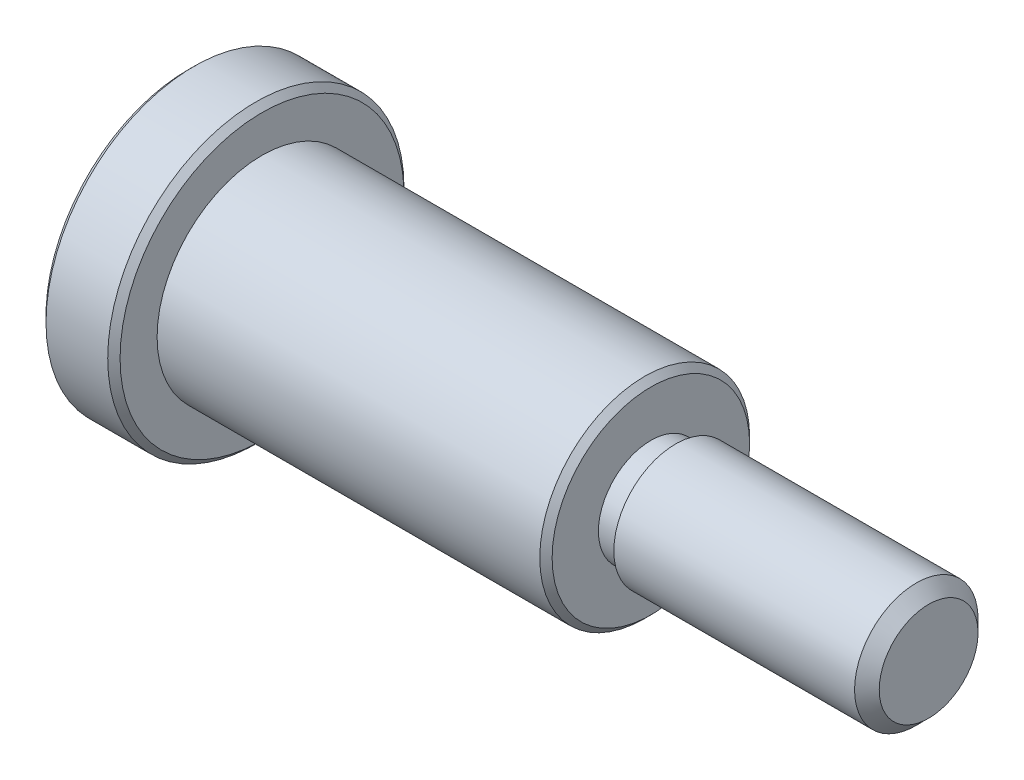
ISO-10303-21;
HEADER;
FILE_DESCRIPTION(('STEP AP214'),'2;1');
FILE_NAME('part.step','',(''),(''),'','','');
FILE_SCHEMA(('AUTOMOTIVE_DESIGN { 1 0 10303 214 1 1 1 1 }'));
ENDSEC;
DATA;
#1=APPLICATION_CONTEXT('core data for automotive mechanical design processes');
#2=APPLICATION_PROTOCOL_DEFINITION('international standard','automotive_design',2000,#1);
#3=PRODUCT_CONTEXT('',#1,'mechanical');
#4=PRODUCT('Part','Part','',(#3));
#5=PRODUCT_RELATED_PRODUCT_CATEGORY('part','',(#4));
#6=PRODUCT_DEFINITION_FORMATION('','',#4);
#7=PRODUCT_DEFINITION_CONTEXT('part definition',#1,'design');
#8=PRODUCT_DEFINITION('design','',#6,#7);
#9=PRODUCT_DEFINITION_SHAPE('','',#8);
#10=(LENGTH_UNIT() NAMED_UNIT(*) SI_UNIT(.MILLI.,.METRE.));
#11=(NAMED_UNIT(*) PLANE_ANGLE_UNIT() SI_UNIT($,.RADIAN.));
#12=(NAMED_UNIT(*) SI_UNIT($,.STERADIAN.) SOLID_ANGLE_UNIT());
#13=UNCERTAINTY_MEASURE_WITH_UNIT(LENGTH_MEASURE(1.E-05),#10,'distance_accuracy_value','');
#14=(GEOMETRIC_REPRESENTATION_CONTEXT(3) GLOBAL_UNCERTAINTY_ASSIGNED_CONTEXT((#13)) GLOBAL_UNIT_ASSIGNED_CONTEXT((#10,
#11,#12)) REPRESENTATION_CONTEXT('',''));
#15=CARTESIAN_POINT('',(0.,0.,0.));
#16=DIRECTION('',(0.,0.,1.));
#17=DIRECTION('',(1.,0.,0.));
#18=AXIS2_PLACEMENT_3D('',#15,#16,#17);
#19=CARTESIAN_POINT('',(0.999999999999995,0.,0.));
#20=DIRECTION('',(-1.,0.,0.));
#21=DIRECTION('',(0.,0.,1.));
#22=AXIS2_PLACEMENT_3D('',#19,#20,#21);
#23=CONICAL_SURFACE('',#22,5.,0.78539816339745);
#24=CARTESIAN_POINT('',(-2.07559788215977,-6.18185094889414,5.19615242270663));
#25=CARTESIAN_POINT('',(-1.96105952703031,-6.03219120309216,5.19615242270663));
#26=CARTESIAN_POINT('',(-1.84756955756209,-5.88171616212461,5.19615242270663));
#27=CARTESIAN_POINT('',(-1.62316269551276,-5.57880548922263,5.19615242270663));
#28=CARTESIAN_POINT('',(-1.51224642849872,-5.42636939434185,5.19615242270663));
#29=CARTESIAN_POINT('',(-1.29267383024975,-5.11809191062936,5.19615242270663));
#30=CARTESIAN_POINT('',(-1.18404158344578,-4.96223331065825,5.19615242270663));
#31=CARTESIAN_POINT('',(-0.970632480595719,-4.64790705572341,5.19615242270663));
#32=CARTESIAN_POINT('',(-0.865855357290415,-4.48943958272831,5.19615242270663));
#33=CARTESIAN_POINT('',(-0.654718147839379,-4.15960466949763,5.19615242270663));
#34=CARTESIAN_POINT('',(-0.548658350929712,-3.98804403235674,5.19615242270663));
#35=CARTESIAN_POINT('',(-0.343229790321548,-3.64089952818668,5.19615242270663));
#36=CARTESIAN_POINT('',(-0.243862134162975,-3.46531500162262,5.19615242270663));
#37=CARTESIAN_POINT('',(-0.0539420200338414,-3.11009275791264,5.19615242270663));
#38=CARTESIAN_POINT('',(0.0366363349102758,-2.93046899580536,5.19615242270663));
#39=CARTESIAN_POINT('',(0.206948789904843,-2.56619278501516,5.19615242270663));
#40=CARTESIAN_POINT('',(0.286687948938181,-2.38154273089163,5.19615242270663));
#41=CARTESIAN_POINT('',(0.425614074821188,-2.0244068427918,5.19615242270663));
#42=CARTESIAN_POINT('',(0.486026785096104,-1.85240274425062,5.19615242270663));
#43=CARTESIAN_POINT('',(0.593076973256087,-1.50407975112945,5.19615242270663));
#44=CARTESIAN_POINT('',(0.639713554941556,-1.32776057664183,5.19615242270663));
#45=CARTESIAN_POINT('',(0.715936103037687,-0.974891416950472,5.19615242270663));
#46=CARTESIAN_POINT('',(0.745826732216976,-0.798408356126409,5.19615242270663));
#47=CARTESIAN_POINT('',(0.787945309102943,-0.443335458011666,5.19615242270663));
#48=CARTESIAN_POINT('',(0.800176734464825,-0.264746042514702,5.19615242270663));
#49=CARTESIAN_POINT('',(0.805972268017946,0.0853231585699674,5.19615242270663));
#50=CARTESIAN_POINT('',(0.80028947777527,0.256790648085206,5.19615242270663));
#51=CARTESIAN_POINT('',(0.772281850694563,0.598351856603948,5.19615242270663));
#52=CARTESIAN_POINT('',(0.749955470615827,0.768445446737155,5.19615242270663));
#53=CARTESIAN_POINT('',(0.68953098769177,1.1089080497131,5.19615242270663));
#54=CARTESIAN_POINT('',(0.651157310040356,1.27922733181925,5.19615242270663));
#55=CARTESIAN_POINT('',(0.560743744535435,1.61612737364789,5.19615242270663));
#56=CARTESIAN_POINT('',(0.508704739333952,1.78270837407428,5.19615242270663));
#57=CARTESIAN_POINT('',(0.389334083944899,2.12288400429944,5.19615242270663));
#58=CARTESIAN_POINT('',(0.321209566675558,2.29619732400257,5.19615242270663));
#59=CARTESIAN_POINT('',(0.174451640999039,2.63835544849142,5.19615242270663));
#60=CARTESIAN_POINT('',(0.0958134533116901,2.80719817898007,5.19615242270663));
#61=CARTESIAN_POINT('',(-0.0701055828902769,3.14121944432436,5.19615242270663));
#62=CARTESIAN_POINT('',(-0.157413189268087,3.30638457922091,5.19615242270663));
#63=CARTESIAN_POINT('',(-0.338747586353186,3.63292620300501,5.19615242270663));
#64=CARTESIAN_POINT('',(-0.432773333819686,3.79430327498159,5.19615242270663));
#65=CARTESIAN_POINT('',(-0.62144544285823,4.1058655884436,5.19615242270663));
#66=CARTESIAN_POINT('',(-0.715831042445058,4.25620957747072,5.19615242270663));
#67=CARTESIAN_POINT('',(-0.908608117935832,4.55431494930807,5.19615242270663));
#68=CARTESIAN_POINT('',(-1.00699989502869,4.70207613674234,5.19615242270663));
#69=CARTESIAN_POINT('',(-1.20627052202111,4.99416315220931,5.19615242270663));
#70=CARTESIAN_POINT('',(-1.30712296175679,5.13850706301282,5.19615242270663));
#71=CARTESIAN_POINT('',(-1.51152254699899,5.42521646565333,5.19615242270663));
#72=CARTESIAN_POINT('',(-1.61506894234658,5.56758249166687,5.19615242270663));
#73=CARTESIAN_POINT('',(-1.71971772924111,5.70911918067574,5.19615242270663));
#74=B_SPLINE_CURVE_WITH_KNOTS('',3,(#24,#25,#26,#27,#28,#29,#30,#31,#32,#33,#34,#35,#36,#37,#38,
#39,#40,#41,#42,#43,#44,#45,#46,#47,#48,#49,#50,#51,#52,#53,#54,#55,#56,#57,#58,#59,#60,#61,#62,
#63,#64,#65,#66,#67,#68,#69,#70,#71,#72,#73),.UNSPECIFIED.,.F.,.F.,(4,2,2,2,2,2,2,2,2,2,2,2,2,2,
2,2,2,2,2,2,2,2,2,2,4),(0.,0.565389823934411,1.13091566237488,1.70081124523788,2.27066724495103,
2.87563727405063,3.48070718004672,4.08393641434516,4.68688312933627,5.23332426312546,
5.77980093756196,6.31598261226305,6.85205868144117,7.36590358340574,7.87979613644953,
8.40290159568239,8.92597327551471,9.48420805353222,10.0426974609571,10.6029676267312,
11.1631509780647,11.6956247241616,12.2281385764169,12.7563639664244,13.2844438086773),.UNSPECIFIED.);
#75=CARTESIAN_POINT('',(0.,-3.,5.19615242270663));
#76=VERTEX_POINT('',#75);
#77=CARTESIAN_POINT('',(0.,3.,5.19615242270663));
#78=VERTEX_POINT('',#77);
#79=EDGE_CURVE('E11',#76,#78,#74,.T.);
#80=ORIENTED_EDGE('',*,*,#79,.F.);
#81=CARTESIAN_POINT('',(0.,0.,0.));
#82=DIRECTION('',(1.,0.,0.));
#83=DIRECTION('',(0.,0.,-1.));
#84=AXIS2_PLACEMENT_3D('',#81,#82,#83);
#85=CIRCLE('',#84,6.);
#86=EDGE_CURVE('E269',#78,#76,#85,.T.);
#87=ORIENTED_EDGE('',*,*,#86,.F.);
#88=EDGE_LOOP('',(#80,#87));
#89=FACE_BOUND('',#88,.T.);
#90=ADVANCED_FACE('F36',(#89),#23,.F.);
#91=CARTESIAN_POINT('',(-0.000115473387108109,-6.00011547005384,-0.0001999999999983));
#92=CARTESIAN_POINT('',(0.0514632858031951,-5.94853194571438,0.0891452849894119));
#93=CARTESIAN_POINT('',(0.101459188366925,-5.89655192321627,0.179177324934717));
#94=CARTESIAN_POINT('',(0.197803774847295,-5.79172109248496,0.360749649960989));
#95=CARTESIAN_POINT('',(0.244150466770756,-5.73886982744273,0.452290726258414));
#96=CARTESIAN_POINT('',(0.377389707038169,-5.57840146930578,0.730230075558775));
#97=CARTESIAN_POINT('',(0.457912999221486,-5.46942591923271,0.9189812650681));
#98=CARTESIAN_POINT('',(0.59580367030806,-5.2496679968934,1.29961315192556));
#99=CARTESIAN_POINT('',(0.653518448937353,-5.13894179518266,1.49139655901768));
#100=CARTESIAN_POINT('',(0.720280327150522,-4.97103208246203,1.7822247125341));
#101=CARTESIAN_POINT('',(0.739223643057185,-4.91481496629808,1.87959561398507));
#102=CARTESIAN_POINT('',(0.77007816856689,-4.80190472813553,2.0751618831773));
#103=CARTESIAN_POINT('',(0.781990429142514,-4.74521167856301,2.17335712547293));
#104=CARTESIAN_POINT('',(0.801962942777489,-4.60705943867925,2.41264382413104));
#105=CARTESIAN_POINT('',(0.806153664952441,-4.5254513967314,2.55399309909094));
#106=CARTESIAN_POINT('',(0.799120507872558,-4.36238238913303,2.83643690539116));
#107=CARTESIAN_POINT('',(0.787891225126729,-4.28092148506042,2.97753133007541));
#108=CARTESIAN_POINT('',(0.750679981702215,-4.11876766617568,3.25838998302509));
#109=CARTESIAN_POINT('',(0.724681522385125,-4.03807571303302,3.39815254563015));
#110=CARTESIAN_POINT('',(0.659345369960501,-3.87807870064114,3.67527550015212));
#111=CARTESIAN_POINT('',(0.620008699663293,-3.79877353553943,3.81263607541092));
#112=CARTESIAN_POINT('',(0.539080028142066,-3.65799091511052,4.05647872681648));
#113=CARTESIAN_POINT('',(0.499616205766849,-3.5962017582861,4.16350068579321));
#114=CARTESIAN_POINT('',(0.41432892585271,-3.47373266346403,4.37562338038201));
#115=CARTESIAN_POINT('',(0.368505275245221,-3.41305275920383,4.48072405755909));
#116=CARTESIAN_POINT('',(0.271525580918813,-3.29299328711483,4.68867316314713));
#117=CARTESIAN_POINT('',(0.220386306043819,-3.23361030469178,4.79152750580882));
#118=CARTESIAN_POINT('',(0.113446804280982,-3.11594398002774,4.99533155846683));
#119=CARTESIAN_POINT('',(0.0576494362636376,-3.05765998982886,5.09628239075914));
#120=CARTESIAN_POINT('',(-0.00011547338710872,-2.99988452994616,5.19635242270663));
#121=B_SPLINE_CURVE_WITH_KNOTS('',3,(#91,#92,#93,#94,#95,#96,#97,#98,#99,#100,#101,#102,#103,
#104,#105,#106,#107,#108,#109,#110,#111,#112,#113,#114,#115,#116,#117,#118,#119,#120),
.UNSPECIFIED.,.F.,.F.,(4,2,2,2,2,2,2,2,2,2,2,2,2,2,4),(0.,0.346006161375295,0.692199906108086,
1.38832512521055,2.07339622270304,2.41525988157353,2.75707242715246,3.24612100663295,
3.73534100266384,4.22510858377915,4.71483861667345,5.10383583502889,5.49284486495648,
5.88066195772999,6.26824275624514),.UNSPECIFIED.);
#122=CARTESIAN_POINT('',(0.,-6.,0.));
#123=VERTEX_POINT('',#122);
#124=EDGE_CURVE('E49',#123,#76,#121,.T.);
#125=ORIENTED_EDGE('',*,*,#124,.F.);
#126=EDGE_CURVE('E272',#76,#123,#85,.T.);
#127=ORIENTED_EDGE('',*,*,#126,.F.);
#128=EDGE_LOOP('',(#125,#127));
#129=FACE_BOUND('',#128,.T.);
#130=ADVANCED_FACE('F250',(#129),#23,.F.);
#131=CARTESIAN_POINT('',(-0.000115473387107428,-2.99988452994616,-5.19635242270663));
#132=CARTESIAN_POINT('',(0.0514632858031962,-3.05146805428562,-5.10700713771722));
#133=CARTESIAN_POINT('',(0.101459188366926,-3.10344807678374,-5.01697509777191));
#134=CARTESIAN_POINT('',(0.197803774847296,-3.20827890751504,-4.83540277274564));
#135=CARTESIAN_POINT('',(0.244150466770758,-3.26113017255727,-4.74386169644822));
#136=CARTESIAN_POINT('',(0.37738970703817,-3.42159853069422,-4.46592234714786));
#137=CARTESIAN_POINT('',(0.457912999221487,-3.53057408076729,-4.27717115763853));
#138=CARTESIAN_POINT('',(0.595803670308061,-3.7503320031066,-3.89653927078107));
#139=CARTESIAN_POINT('',(0.653518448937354,-3.86105820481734,-3.70475586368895));
#140=CARTESIAN_POINT('',(0.720280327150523,-4.02896791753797,-3.41392771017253));
#141=CARTESIAN_POINT('',(0.739223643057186,-4.08518503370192,-3.31655680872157));
#142=CARTESIAN_POINT('',(0.770078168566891,-4.19809527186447,-3.12099053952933));
#143=CARTESIAN_POINT('',(0.781990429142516,-4.25478832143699,-3.0227952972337));
#144=CARTESIAN_POINT('',(0.80196294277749,-4.39294056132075,-2.78350859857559));
#145=CARTESIAN_POINT('',(0.806153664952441,-4.4745486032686,-2.64215932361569));
#146=CARTESIAN_POINT('',(0.799120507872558,-4.63761761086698,-2.35971551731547));
#147=CARTESIAN_POINT('',(0.78789122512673,-4.71907851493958,-2.21862109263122));
#148=CARTESIAN_POINT('',(0.750679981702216,-4.88123233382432,-1.93776243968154));
#149=CARTESIAN_POINT('',(0.724681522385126,-4.96192428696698,-1.79799987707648));
#150=CARTESIAN_POINT('',(0.659345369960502,-5.12192129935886,-1.52087692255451));
#151=CARTESIAN_POINT('',(0.620008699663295,-5.20122646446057,-1.38351634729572));
#152=CARTESIAN_POINT('',(0.539080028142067,-5.34200908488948,-1.13967369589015));
#153=CARTESIAN_POINT('',(0.49961620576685,-5.4037982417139,-1.03265173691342));
#154=CARTESIAN_POINT('',(0.414328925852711,-5.52626733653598,-0.820529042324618));
#155=CARTESIAN_POINT('',(0.368505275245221,-5.58694724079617,-0.715428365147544));
#156=CARTESIAN_POINT('',(0.271525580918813,-5.70700671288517,-0.507479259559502));
#157=CARTESIAN_POINT('',(0.220386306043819,-5.76638969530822,-0.404624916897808));
#158=CARTESIAN_POINT('',(0.113446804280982,-5.88405601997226,-0.2008208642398));
#159=CARTESIAN_POINT('',(0.057649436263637,-5.94234001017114,-0.099870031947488));
#160=CARTESIAN_POINT('',(-0.00011547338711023,-6.00011547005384,0.000200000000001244));
#161=B_SPLINE_CURVE_WITH_KNOTS('',3,(#131,#132,#133,#134,#135,#136,#137,#138,#139,#140,#141,
#142,#143,#144,#145,#146,#147,#148,#149,#150,#151,#152,#153,#154,#155,#156,#157,#158,#159,#160),
.UNSPECIFIED.,.F.,.F.,(4,2,2,2,2,2,2,2,2,2,2,2,2,2,4),(0.,0.346006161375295,0.692199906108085,
1.38832512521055,2.07339622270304,2.41525988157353,2.75707242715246,3.24612100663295,
3.73534100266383,4.22510858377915,4.71483861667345,5.10383583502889,5.49284486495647,
5.88066195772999,6.26824275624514),.UNSPECIFIED.);
#162=CARTESIAN_POINT('',(0.,-3.,-5.19615242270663));
#163=VERTEX_POINT('',#162);
#164=EDGE_CURVE('E280',#163,#123,#161,.T.);
#165=ORIENTED_EDGE('',*,*,#164,.F.);
#166=EDGE_CURVE('E310',#123,#163,#85,.T.);
#167=ORIENTED_EDGE('',*,*,#166,.F.);
#168=EDGE_LOOP('',(#165,#167));
#169=FACE_BOUND('',#168,.T.);
#170=ADVANCED_FACE('F255',(#169),#23,.F.);
#171=CARTESIAN_POINT('',(-2.07559788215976,-6.18185094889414,-5.19615242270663));
#172=CARTESIAN_POINT('',(-1.96105952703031,-6.03219120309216,-5.19615242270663));
#173=CARTESIAN_POINT('',(-1.84756955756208,-5.8817161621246,-5.19615242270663));
#174=CARTESIAN_POINT('',(-1.62316269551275,-5.57880548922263,-5.19615242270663));
#175=CARTESIAN_POINT('',(-1.51224642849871,-5.42636939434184,-5.19615242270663));
#176=CARTESIAN_POINT('',(-1.29267383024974,-5.11809191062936,-5.19615242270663));
#177=CARTESIAN_POINT('',(-1.18404158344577,-4.96223331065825,-5.19615242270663));
#178=CARTESIAN_POINT('',(-0.970632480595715,-4.64790705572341,-5.19615242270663));
#179=CARTESIAN_POINT('',(-0.865855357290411,-4.48943958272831,-5.19615242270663));
#180=CARTESIAN_POINT('',(-0.654718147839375,-4.15960466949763,-5.19615242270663));
#181=CARTESIAN_POINT('',(-0.548658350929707,-3.98804403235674,-5.19615242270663));
#182=CARTESIAN_POINT('',(-0.343229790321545,-3.64089952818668,-5.19615242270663));
#183=CARTESIAN_POINT('',(-0.243862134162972,-3.46531500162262,-5.19615242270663));
#184=CARTESIAN_POINT('',(-0.053942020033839,-3.11009275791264,-5.19615242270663));
#185=CARTESIAN_POINT('',(0.0366363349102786,-2.93046899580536,-5.19615242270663));
#186=CARTESIAN_POINT('',(0.206948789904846,-2.56619278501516,-5.19615242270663));
#187=CARTESIAN_POINT('',(0.286687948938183,-2.38154273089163,-5.19615242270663));
#188=CARTESIAN_POINT('',(0.42561407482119,-2.02440684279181,-5.19615242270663));
#189=CARTESIAN_POINT('',(0.486026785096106,-1.85240274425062,-5.19615242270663));
#190=CARTESIAN_POINT('',(0.593076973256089,-1.50407975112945,-5.19615242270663));
#191=CARTESIAN_POINT('',(0.639713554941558,-1.32776057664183,-5.19615242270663));
#192=CARTESIAN_POINT('',(0.715936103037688,-0.974891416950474,-5.19615242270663));
#193=CARTESIAN_POINT('',(0.745826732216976,-0.79840835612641,-5.19615242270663));
#194=CARTESIAN_POINT('',(0.787945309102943,-0.443335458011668,-5.19615242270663));
#195=CARTESIAN_POINT('',(0.800176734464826,-0.264746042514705,-5.19615242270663));
#196=CARTESIAN_POINT('',(0.805972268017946,0.0853231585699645,-5.19615242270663));
#197=CARTESIAN_POINT('',(0.800289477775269,0.256790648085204,-5.19615242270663));
#198=CARTESIAN_POINT('',(0.772281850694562,0.598351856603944,-5.19615242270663));
#199=CARTESIAN_POINT('',(0.749955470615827,0.768445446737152,-5.19615242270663));
#200=CARTESIAN_POINT('',(0.68953098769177,1.10890804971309,-5.19615242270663));
#201=CARTESIAN_POINT('',(0.651157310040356,1.27922733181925,-5.19615242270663));
#202=CARTESIAN_POINT('',(0.560743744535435,1.61612737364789,-5.19615242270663));
#203=CARTESIAN_POINT('',(0.508704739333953,1.78270837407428,-5.19615242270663));
#204=CARTESIAN_POINT('',(0.389334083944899,2.12288400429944,-5.19615242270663));
#205=CARTESIAN_POINT('',(0.321209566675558,2.29619732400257,-5.19615242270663));
#206=CARTESIAN_POINT('',(0.17445164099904,2.63835544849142,-5.19615242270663));
#207=CARTESIAN_POINT('',(0.0958134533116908,2.80719817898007,-5.19615242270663));
#208=CARTESIAN_POINT('',(-0.0701055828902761,3.14121944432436,-5.19615242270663));
#209=CARTESIAN_POINT('',(-0.157413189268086,3.30638457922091,-5.19615242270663));
#210=CARTESIAN_POINT('',(-0.338747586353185,3.63292620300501,-5.19615242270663));
#211=CARTESIAN_POINT('',(-0.432773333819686,3.79430327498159,-5.19615242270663));
#212=CARTESIAN_POINT('',(-0.621445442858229,4.1058655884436,-5.19615242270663));
#213=CARTESIAN_POINT('',(-0.715831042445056,4.25620957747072,-5.19615242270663));
#214=CARTESIAN_POINT('',(-0.90860811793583,4.55431494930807,-5.19615242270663));
#215=CARTESIAN_POINT('',(-1.00699989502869,4.70207613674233,-5.19615242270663));
#216=CARTESIAN_POINT('',(-1.20627052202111,4.9941631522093,-5.19615242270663));
#217=CARTESIAN_POINT('',(-1.30712296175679,5.13850706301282,-5.19615242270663));
#218=CARTESIAN_POINT('',(-1.51152254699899,5.42521646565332,-5.19615242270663));
#219=CARTESIAN_POINT('',(-1.61506894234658,5.56758249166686,-5.19615242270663));
#220=CARTESIAN_POINT('',(-1.7197177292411,5.70911918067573,-5.19615242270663));
#221=B_SPLINE_CURVE_WITH_KNOTS('',3,(#171,#172,#173,#174,#175,#176,#177,#178,#179,#180,#181,
#182,#183,#184,#185,#186,#187,#188,#189,#190,#191,#192,#193,#194,#195,#196,#197,#198,#199,#200,
#201,#202,#203,#204,#205,#206,#207,#208,#209,#210,#211,#212,#213,#214,#215,#216,#217,#218,#219,
#220),.UNSPECIFIED.,.F.,.F.,(4,2,2,2,2,2,2,2,2,2,2,2,2,2,2,2,2,2,2,2,2,2,2,2,4),(0.,
0.565389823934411,1.13091566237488,1.70081124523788,2.27066724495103,2.87563727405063,
3.48070718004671,4.08393641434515,4.68688312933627,5.23332426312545,5.77980093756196,
6.31598261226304,6.85205868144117,7.36590358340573,7.87979613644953,8.40290159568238,
8.9259732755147,9.48420805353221,10.0426974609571,10.6029676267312,11.1631509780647,
11.6956247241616,12.2281385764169,12.7563639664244,13.2844438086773),.UNSPECIFIED.);
#222=CARTESIAN_POINT('',(0.,3.,-5.19615242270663));
#223=VERTEX_POINT('',#222);
#224=EDGE_CURVE('E279',#223,#163,#221,.F.);
#225=ORIENTED_EDGE('',*,*,#224,.F.);
#226=EDGE_CURVE('E151',#163,#223,#85,.T.);
#227=ORIENTED_EDGE('',*,*,#226,.F.);
#228=EDGE_LOOP('',(#225,#227));
#229=FACE_BOUND('',#228,.T.);
#230=ADVANCED_FACE('F246',(#229),#23,.F.);
#231=CARTESIAN_POINT('',(-0.000115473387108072,6.00011547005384,0.000200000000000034));
#232=CARTESIAN_POINT('',(0.0514632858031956,5.94853194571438,-0.08914528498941));
#233=CARTESIAN_POINT('',(0.101459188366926,5.89655192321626,-0.179177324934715));
#234=CARTESIAN_POINT('',(0.197803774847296,5.79172109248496,-0.360749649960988));
#235=CARTESIAN_POINT('',(0.244150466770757,5.73886982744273,-0.452290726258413));
#236=CARTESIAN_POINT('',(0.37738970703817,5.57840146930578,-0.730230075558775));
#237=CARTESIAN_POINT('',(0.457912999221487,5.46942591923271,-0.9189812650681));
#238=CARTESIAN_POINT('',(0.595803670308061,5.2496679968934,-1.29961315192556));
#239=CARTESIAN_POINT('',(0.653518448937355,5.13894179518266,-1.49139655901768));
#240=CARTESIAN_POINT('',(0.720280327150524,4.97103208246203,-1.7822247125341));
#241=CARTESIAN_POINT('',(0.739223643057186,4.91481496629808,-1.87959561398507));
#242=CARTESIAN_POINT('',(0.770078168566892,4.80190472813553,-2.0751618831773));
#243=CARTESIAN_POINT('',(0.781990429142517,4.74521167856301,-2.17335712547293));
#244=CARTESIAN_POINT('',(0.801962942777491,4.60705943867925,-2.41264382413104));
#245=CARTESIAN_POINT('',(0.806153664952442,4.5254513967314,-2.55399309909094));
#246=CARTESIAN_POINT('',(0.79912050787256,4.36238238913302,-2.83643690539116));
#247=CARTESIAN_POINT('',(0.787891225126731,4.28092148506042,-2.97753133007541));
#248=CARTESIAN_POINT('',(0.750679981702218,4.11876766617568,-3.25838998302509));
#249=CARTESIAN_POINT('',(0.724681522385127,4.03807571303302,-3.39815254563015));
#250=CARTESIAN_POINT('',(0.659345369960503,3.87807870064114,-3.67527550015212));
#251=CARTESIAN_POINT('',(0.620008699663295,3.79877353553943,-3.81263607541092));
#252=CARTESIAN_POINT('',(0.539080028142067,3.65799091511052,-4.05647872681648));
#253=CARTESIAN_POINT('',(0.49961620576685,3.5962017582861,-4.16350068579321));
#254=CARTESIAN_POINT('',(0.414328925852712,3.47373266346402,-4.37562338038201));
#255=CARTESIAN_POINT('',(0.368505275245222,3.41305275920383,-4.48072405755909));
#256=CARTESIAN_POINT('',(0.271525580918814,3.29299328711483,-4.68867316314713));
#257=CARTESIAN_POINT('',(0.220386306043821,3.23361030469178,-4.79152750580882));
#258=CARTESIAN_POINT('',(0.113446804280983,3.11594398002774,-4.99533155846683));
#259=CARTESIAN_POINT('',(0.057649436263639,3.05765998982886,-5.09628239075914));
#260=CARTESIAN_POINT('',(-0.000115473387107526,2.99988452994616,-5.19635242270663));
#261=B_SPLINE_CURVE_WITH_KNOTS('',3,(#231,#232,#233,#234,#235,#236,#237,#238,#239,#240,#241,
#242,#243,#244,#245,#246,#247,#248,#249,#250,#251,#252,#253,#254,#255,#256,#257,#258,#259,#260),
.UNSPECIFIED.,.F.,.F.,(4,2,2,2,2,2,2,2,2,2,2,2,2,2,4),(0.,0.346006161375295,0.692199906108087,
1.38832512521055,2.07339622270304,2.41525988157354,2.75707242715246,3.24612100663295,
3.73534100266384,4.22510858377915,4.71483861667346,5.1038358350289,5.49284486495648,
5.88066195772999,6.26824275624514),.UNSPECIFIED.);
#262=CARTESIAN_POINT('',(0.,6.,0.));
#263=VERTEX_POINT('',#262);
#264=EDGE_CURVE('E186',#263,#223,#261,.T.);
#265=ORIENTED_EDGE('',*,*,#264,.F.);
#266=EDGE_CURVE('E152',#223,#263,#85,.T.);
#267=ORIENTED_EDGE('',*,*,#266,.F.);
#268=EDGE_LOOP('',(#265,#267));
#269=FACE_BOUND('',#268,.T.);
#270=ADVANCED_FACE('F241',(#269),#23,.F.);
#271=CARTESIAN_POINT('',(0.,12.,0.));
#272=DIRECTION('',(1.,0.,0.));
#273=DIRECTION('',(0.,0.,-1.));
#274=AXIS2_PLACEMENT_3D('',#271,#272,#273);
#275=PLANE('',#274);
#276=CARTESIAN_POINT('',(0.,0.,0.));
#277=DIRECTION('',(1.,0.,0.));
#278=DIRECTION('',(0.,0.,-1.));
#279=AXIS2_PLACEMENT_3D('',#276,#277,#278);
#280=CIRCLE('',#279,11.5);
#281=CARTESIAN_POINT('',(0.,0.,-11.5));
#282=VERTEX_POINT('',#281);
#283=EDGE_CURVE('E162',#282,#282,#280,.F.);
#284=ORIENTED_EDGE('',*,*,#283,.T.);
#285=EDGE_LOOP('',(#284));
#286=FACE_BOUND('',#285,.T.);
#287=ORIENTED_EDGE('',*,*,#266,.T.);
#288=EDGE_CURVE('E156',#263,#78,#85,.T.);
#289=ORIENTED_EDGE('',*,*,#288,.T.);
#290=ORIENTED_EDGE('',*,*,#86,.T.);
#291=ORIENTED_EDGE('',*,*,#126,.T.);
#292=ORIENTED_EDGE('',*,*,#166,.T.);
#293=ORIENTED_EDGE('',*,*,#226,.T.);
#294=EDGE_LOOP('',(#287,#289,#290,#291,#292,#293));
#295=FACE_BOUND('',#294,.T.);
#296=ADVANCED_FACE('F238',(#286,#295),#275,.F.);
#297=CARTESIAN_POINT('',(-44.5183646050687,0.,0.));
#298=DIRECTION('',(-1.,0.,0.));
#299=DIRECTION('',(0.,0.,1.));
#300=AXIS2_PLACEMENT_3D('',#297,#298,#299);
#301=CYLINDRICAL_SURFACE('',#300,12.);
#302=CARTESIAN_POINT('',(0.500000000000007,0.,0.));
#303=DIRECTION('',(1.,0.,0.));
#304=DIRECTION('',(0.,0.,-1.));
#305=AXIS2_PLACEMENT_3D('',#302,#303,#304);
#306=CIRCLE('',#305,12.);
#307=CARTESIAN_POINT('',(0.500000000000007,0.,-12.));
#308=VERTEX_POINT('',#307);
#309=EDGE_CURVE('E168',#308,#308,#306,.T.);
#310=ORIENTED_EDGE('',*,*,#309,.T.);
#311=EDGE_LOOP('',(#310));
#312=FACE_BOUND('',#311,.T.);
#313=CARTESIAN_POINT('',(5.50000000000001,0.,0.));
#314=DIRECTION('',(-1.,0.,0.));
#315=DIRECTION('',(0.,0.,1.));
#316=AXIS2_PLACEMENT_3D('',#313,#314,#315);
#317=CIRCLE('',#316,12.);
#318=CARTESIAN_POINT('',(5.50000000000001,0.,12.));
#319=VERTEX_POINT('',#318);
#320=EDGE_CURVE('E165',#319,#319,#317,.T.);
#321=ORIENTED_EDGE('',*,*,#320,.T.);
#322=EDGE_LOOP('',(#321));
#323=FACE_BOUND('',#322,.T.);
#324=ADVANCED_FACE('F235',(#312,#323),#301,.T.);
#325=CARTESIAN_POINT('',(6.,12.,0.));
#326=DIRECTION('',(-1.,0.,0.));
#327=DIRECTION('',(0.,0.,1.));
#328=AXIS2_PLACEMENT_3D('',#325,#326,#327);
#329=PLANE('',#328);
#330=CARTESIAN_POINT('',(6.,0.,0.));
#331=DIRECTION('',(-1.,0.,0.));
#332=DIRECTION('',(0.,0.,1.));
#333=AXIS2_PLACEMENT_3D('',#330,#331,#332);
#334=CIRCLE('',#333,11.5);
#335=CARTESIAN_POINT('',(6.,0.,11.5));
#336=VERTEX_POINT('',#335);
#337=EDGE_CURVE('E171',#336,#336,#334,.F.);
#338=ORIENTED_EDGE('',*,*,#337,.T.);
#339=EDGE_LOOP('',(#338));
#340=FACE_BOUND('',#339,.T.);
#341=CARTESIAN_POINT('',(6.,0.,0.));
#342=DIRECTION('',(-1.,0.,0.));
#343=DIRECTION('',(0.,0.,1.));
#344=AXIS2_PLACEMENT_3D('',#341,#342,#343);
#345=CIRCLE('',#344,8.5);
#346=CARTESIAN_POINT('',(6.,0.,8.5));
#347=VERTEX_POINT('',#346);
#348=EDGE_CURVE('E148',#347,#347,#345,.T.);
#349=ORIENTED_EDGE('',*,*,#348,.T.);
#350=EDGE_LOOP('',(#349));
#351=FACE_BOUND('',#350,.T.);
#352=ADVANCED_FACE('F231',(#340,#351),#329,.F.);
#353=CARTESIAN_POINT('',(-44.5183646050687,0.,0.));
#354=DIRECTION('',(-1.,0.,0.));
#355=DIRECTION('',(0.,0.,1.));
#356=AXIS2_PLACEMENT_3D('',#353,#354,#355);
#357=CYLINDRICAL_SURFACE('',#356,8.5);
#358=CARTESIAN_POINT('',(37.,0.,0.));
#359=DIRECTION('',(-1.,0.,0.));
#360=DIRECTION('',(0.,0.,1.));
#361=AXIS2_PLACEMENT_3D('',#358,#359,#360);
#362=CIRCLE('',#361,8.5);
#363=CARTESIAN_POINT('',(37.,0.,8.5));
#364=VERTEX_POINT('',#363);
#365=EDGE_CURVE('E174',#364,#364,#362,.T.);
#366=ORIENTED_EDGE('',*,*,#365,.T.);
#367=EDGE_LOOP('',(#366));
#368=FACE_BOUND('',#367,.T.);
#369=ORIENTED_EDGE('',*,*,#348,.F.);
#370=EDGE_LOOP('',(#369));
#371=FACE_BOUND('',#370,.T.);
#372=ADVANCED_FACE('F227',(#368,#371),#357,.T.);
#373=CARTESIAN_POINT('',(37.5,8.5,0.));
#374=DIRECTION('',(-1.,0.,0.));
#375=DIRECTION('',(0.,0.,1.));
#376=AXIS2_PLACEMENT_3D('',#373,#374,#375);
#377=PLANE('',#376);
#378=CARTESIAN_POINT('',(37.5,0.,0.));
#379=DIRECTION('',(-1.,0.,0.));
#380=DIRECTION('',(0.,0.,1.));
#381=AXIS2_PLACEMENT_3D('',#378,#379,#380);
#382=CIRCLE('',#381,8.00000000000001);
#383=CARTESIAN_POINT('',(37.5,0.,8.00000000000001));
#384=VERTEX_POINT('',#383);
#385=EDGE_CURVE('E177',#384,#384,#382,.F.);
#386=ORIENTED_EDGE('',*,*,#385,.T.);
#387=EDGE_LOOP('',(#386));
#388=FACE_BOUND('',#387,.T.);
#389=CARTESIAN_POINT('',(37.5,0.,0.));
#390=DIRECTION('',(-1.,0.,0.));
#391=DIRECTION('',(0.,0.,1.));
#392=AXIS2_PLACEMENT_3D('',#389,#390,#391);
#393=CIRCLE('',#392,4.25);
#394=CARTESIAN_POINT('',(37.5,0.,4.25));
#395=VERTEX_POINT('',#394);
#396=EDGE_CURVE('E145',#395,#395,#393,.T.);
#397=ORIENTED_EDGE('',*,*,#396,.T.);
#398=EDGE_LOOP('',(#397));
#399=FACE_BOUND('',#398,.T.);
#400=ADVANCED_FACE('F223',(#388,#399),#377,.F.);
#401=CARTESIAN_POINT('',(-44.5183646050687,0.,0.));
#402=DIRECTION('',(-1.,0.,0.));
#403=DIRECTION('',(0.,0.,1.));
#404=AXIS2_PLACEMENT_3D('',#401,#402,#403);
#405=CYLINDRICAL_SURFACE('',#404,4.25);
#406=ORIENTED_EDGE('',*,*,#396,.F.);
#407=EDGE_LOOP('',(#406));
#408=FACE_BOUND('',#407,.T.);
#409=CARTESIAN_POINT('',(39.5,0.,0.));
#410=DIRECTION('',(-1.,0.,0.));
#411=DIRECTION('',(0.,0.,1.));
#412=AXIS2_PLACEMENT_3D('',#409,#410,#411);
#413=CIRCLE('',#412,4.25);
#414=CARTESIAN_POINT('',(39.5,0.,4.25));
#415=VERTEX_POINT('',#414);
#416=EDGE_CURVE('E142',#415,#415,#413,.T.);
#417=ORIENTED_EDGE('',*,*,#416,.T.);
#418=EDGE_LOOP('',(#417));
#419=FACE_BOUND('',#418,.T.);
#420=ADVANCED_FACE('F219',(#408,#419),#405,.T.);
#421=CARTESIAN_POINT('',(39.5,4.25,0.));
#422=DIRECTION('',(1.,0.,0.));
#423=DIRECTION('',(0.,0.,-1.));
#424=AXIS2_PLACEMENT_3D('',#421,#422,#423);
#425=PLANE('',#424);
#426=ORIENTED_EDGE('',*,*,#416,.F.);
#427=EDGE_LOOP('',(#426));
#428=FACE_BOUND('',#427,.T.);
#429=CARTESIAN_POINT('',(39.5,0.,0.));
#430=DIRECTION('',(-1.,0.,0.));
#431=DIRECTION('',(0.,0.,1.));
#432=AXIS2_PLACEMENT_3D('',#429,#430,#431);
#433=CIRCLE('',#432,5.);
#434=CARTESIAN_POINT('',(39.5,0.,5.));
#435=VERTEX_POINT('',#434);
#436=EDGE_CURVE('E139',#435,#435,#433,.T.);
#437=ORIENTED_EDGE('',*,*,#436,.T.);
#438=EDGE_LOOP('',(#437));
#439=FACE_BOUND('',#438,.T.);
#440=ADVANCED_FACE('F215',(#428,#439),#425,.F.);
#441=CARTESIAN_POINT('',(-44.5183646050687,0.,0.));
#442=DIRECTION('',(-1.,0.,0.));
#443=DIRECTION('',(0.,0.,1.));
#444=AXIS2_PLACEMENT_3D('',#441,#442,#443);
#445=CYLINDRICAL_SURFACE('',#444,5.);
#446=CARTESIAN_POINT('',(59.,0.,0.));
#447=DIRECTION('',(-1.,0.,0.));
#448=DIRECTION('',(0.,0.,1.));
#449=AXIS2_PLACEMENT_3D('',#446,#447,#448);
#450=CIRCLE('',#449,5.);
#451=CARTESIAN_POINT('',(59.,0.,5.));
#452=VERTEX_POINT('',#451);
#453=EDGE_CURVE('E155',#452,#452,#450,.T.);
#454=ORIENTED_EDGE('',*,*,#453,.T.);
#455=EDGE_LOOP('',(#454));
#456=FACE_BOUND('',#455,.T.);
#457=ORIENTED_EDGE('',*,*,#436,.F.);
#458=EDGE_LOOP('',(#457));
#459=FACE_BOUND('',#458,.T.);
#460=ADVANCED_FACE('F211',(#456,#459),#445,.T.);
#461=CARTESIAN_POINT('',(60.,5.,0.));
#462=DIRECTION('',(-1.,0.,0.));
#463=DIRECTION('',(0.,0.,1.));
#464=AXIS2_PLACEMENT_3D('',#461,#462,#463);
#465=PLANE('',#464);
#466=CARTESIAN_POINT('',(60.,0.,0.));
#467=DIRECTION('',(-1.,0.,0.));
#468=DIRECTION('',(0.,0.,1.));
#469=AXIS2_PLACEMENT_3D('',#466,#467,#468);
#470=CIRCLE('',#469,3.99999999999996);
#471=CARTESIAN_POINT('',(60.,0.,3.99999999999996));
#472=VERTEX_POINT('',#471);
#473=EDGE_CURVE('E159',#472,#472,#470,.F.);
#474=ORIENTED_EDGE('',*,*,#473,.T.);
#475=EDGE_LOOP('',(#474));
#476=FACE_BOUND('',#475,.T.);
#477=ADVANCED_FACE('F208',(#476),#465,.F.);
#478=CARTESIAN_POINT('',(-0.000115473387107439,2.99988452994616,5.19635242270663));
#479=CARTESIAN_POINT('',(0.0514632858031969,3.05146805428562,5.10700713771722));
#480=CARTESIAN_POINT('',(0.101459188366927,3.10344807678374,5.01697509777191));
#481=CARTESIAN_POINT('',(0.197803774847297,3.20827890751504,4.83540277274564));
#482=CARTESIAN_POINT('',(0.244150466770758,3.26113017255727,4.74386169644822));
#483=CARTESIAN_POINT('',(0.37738970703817,3.42159853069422,4.46592234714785));
#484=CARTESIAN_POINT('',(0.457912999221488,3.53057408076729,4.27717115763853));
#485=CARTESIAN_POINT('',(0.595803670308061,3.7503320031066,3.89653927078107));
#486=CARTESIAN_POINT('',(0.653518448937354,3.86105820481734,3.70475586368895));
#487=CARTESIAN_POINT('',(0.720280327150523,4.02896791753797,3.41392771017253));
#488=CARTESIAN_POINT('',(0.739223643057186,4.08518503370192,3.31655680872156));
#489=CARTESIAN_POINT('',(0.770078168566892,4.19809527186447,3.12099053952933));
#490=CARTESIAN_POINT('',(0.781990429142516,4.25478832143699,3.0227952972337));
#491=CARTESIAN_POINT('',(0.80196294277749,4.39294056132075,2.78350859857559));
#492=CARTESIAN_POINT('',(0.806153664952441,4.4745486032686,2.64215932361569));
#493=CARTESIAN_POINT('',(0.799120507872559,4.63761761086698,2.35971551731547));
#494=CARTESIAN_POINT('',(0.787891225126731,4.71907851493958,2.21862109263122));
#495=CARTESIAN_POINT('',(0.750679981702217,4.88123233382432,1.93776243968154));
#496=CARTESIAN_POINT('',(0.724681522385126,4.96192428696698,1.79799987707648));
#497=CARTESIAN_POINT('',(0.659345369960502,5.12192129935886,1.52087692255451));
#498=CARTESIAN_POINT('',(0.620008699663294,5.20122646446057,1.38351634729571));
#499=CARTESIAN_POINT('',(0.539080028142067,5.34200908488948,1.13967369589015));
#500=CARTESIAN_POINT('',(0.49961620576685,5.4037982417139,1.03265173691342));
#501=CARTESIAN_POINT('',(0.414328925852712,5.52626733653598,0.820529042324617));
#502=CARTESIAN_POINT('',(0.368505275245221,5.58694724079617,0.715428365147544));
#503=CARTESIAN_POINT('',(0.271525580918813,5.70700671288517,0.507479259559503));
#504=CARTESIAN_POINT('',(0.22038630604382,5.76638969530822,0.404624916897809));
#505=CARTESIAN_POINT('',(0.113446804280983,5.88405601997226,0.200820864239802));
#506=CARTESIAN_POINT('',(0.0576494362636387,5.94234001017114,0.0998700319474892));
#507=CARTESIAN_POINT('',(-0.000115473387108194,6.00011547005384,-0.000200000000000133));
#508=B_SPLINE_CURVE_WITH_KNOTS('',3,(#478,#479,#480,#481,#482,#483,#484,#485,#486,#487,#488,
#489,#490,#491,#492,#493,#494,#495,#496,#497,#498,#499,#500,#501,#502,#503,#504,#505,#506,#507),
.UNSPECIFIED.,.F.,.F.,(4,2,2,2,2,2,2,2,2,2,2,2,2,2,4),(0.,0.346006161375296,0.692199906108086,
1.38832512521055,2.07339622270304,2.41525988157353,2.75707242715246,3.24612100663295,
3.73534100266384,4.22510858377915,4.71483861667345,5.10383583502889,5.49284486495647,
5.88066195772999,6.26824275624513),.UNSPECIFIED.);
#509=EDGE_CURVE('E180',#78,#263,#508,.T.);
#510=ORIENTED_EDGE('',*,*,#509,.F.);
#511=ORIENTED_EDGE('',*,*,#288,.F.);
#512=EDGE_LOOP('',(#510,#511));
#513=FACE_BOUND('',#512,.T.);
#514=ADVANCED_FACE('F192',(#513),#23,.F.);
#515=CARTESIAN_POINT('',(59.,0.,0.));
#516=DIRECTION('',(-1.,0.,0.));
#517=DIRECTION('',(0.,0.,1.));
#518=AXIS2_PLACEMENT_3D('',#515,#516,#517);
#519=CONICAL_SURFACE('',#518,5.,0.785398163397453);
#520=ORIENTED_EDGE('',*,*,#473,.F.);
#521=EDGE_LOOP('',(#520));
#522=FACE_BOUND('',#521,.T.);
#523=ORIENTED_EDGE('',*,*,#453,.F.);
#524=EDGE_LOOP('',(#523));
#525=FACE_BOUND('',#524,.T.);
#526=ADVANCED_FACE('F258',(#522,#525),#519,.T.);
#527=CARTESIAN_POINT('',(0.,0.,0.));
#528=DIRECTION('',(1.,0.,0.));
#529=DIRECTION('',(0.,0.,-1.));
#530=AXIS2_PLACEMENT_3D('',#527,#528,#529);
#531=CONICAL_SURFACE('',#530,11.5,0.785398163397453);
#532=ORIENTED_EDGE('',*,*,#309,.F.);
#533=EDGE_LOOP('',(#532));
#534=FACE_BOUND('',#533,.T.);
#535=ORIENTED_EDGE('',*,*,#283,.F.);
#536=EDGE_LOOP('',(#535));
#537=FACE_BOUND('',#536,.T.);
#538=ADVANCED_FACE('F263',(#534,#537),#531,.T.);
#539=CARTESIAN_POINT('',(5.50000000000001,0.,0.));
#540=DIRECTION('',(-1.,0.,0.));
#541=DIRECTION('',(0.,0.,1.));
#542=AXIS2_PLACEMENT_3D('',#539,#540,#541);
#543=CONICAL_SURFACE('',#542,12.,0.78539816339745);
#544=ORIENTED_EDGE('',*,*,#337,.F.);
#545=EDGE_LOOP('',(#544));
#546=FACE_BOUND('',#545,.T.);
#547=ORIENTED_EDGE('',*,*,#320,.F.);
#548=EDGE_LOOP('',(#547));
#549=FACE_BOUND('',#548,.T.);
#550=ADVANCED_FACE('F336',(#546,#549),#543,.T.);
#551=CARTESIAN_POINT('',(37.,0.,0.));
#552=DIRECTION('',(-1.,0.,0.));
#553=DIRECTION('',(0.,0.,1.));
#554=AXIS2_PLACEMENT_3D('',#551,#552,#553);
#555=CONICAL_SURFACE('',#554,8.5,0.785398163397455);
#556=ORIENTED_EDGE('',*,*,#385,.F.);
#557=EDGE_LOOP('',(#556));
#558=FACE_BOUND('',#557,.T.);
#559=ORIENTED_EDGE('',*,*,#365,.F.);
#560=EDGE_LOOP('',(#559));
#561=FACE_BOUND('',#560,.T.);
#562=ADVANCED_FACE('F38',(#558,#561),#555,.T.);
#563=CARTESIAN_POINT('',(10.,0.,0.));
#564=DIRECTION('',(-1.,0.,0.));
#565=DIRECTION('',(0.,0.,1.));
#566=AXIS2_PLACEMENT_3D('',#563,#564,#565);
#567=PLANE('',#566);
#568=DIRECTION('',(0.,1.,0.));
#569=VECTOR('',#568,1.);
#570=CARTESIAN_POINT('',(10.,-3.,5.19615242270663));
#571=LINE('',#570,#569);
#572=CARTESIAN_POINT('',(10.,-3.,5.19615242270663));
#573=VERTEX_POINT('',#572);
#574=CARTESIAN_POINT('',(10.,3.,5.19615242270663));
#575=VERTEX_POINT('',#574);
#576=EDGE_CURVE('E95',#573,#575,#571,.T.);
#577=ORIENTED_EDGE('',*,*,#576,.T.);
#578=DIRECTION('',(0.,0.5,-0.866025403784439));
#579=VECTOR('',#578,1.);
#580=CARTESIAN_POINT('',(10.,3.,5.19615242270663));
#581=LINE('',#580,#579);
#582=CARTESIAN_POINT('',(10.,6.,0.));
#583=VERTEX_POINT('',#582);
#584=EDGE_CURVE('E103',#575,#583,#581,.T.);
#585=ORIENTED_EDGE('',*,*,#584,.T.);
#586=DIRECTION('',(0.,-0.5,-0.866025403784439));
#587=VECTOR('',#586,1.);
#588=CARTESIAN_POINT('',(10.,6.,0.));
#589=LINE('',#588,#587);
#590=CARTESIAN_POINT('',(10.,3.,-5.19615242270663));
#591=VERTEX_POINT('',#590);
#592=EDGE_CURVE('E109',#583,#591,#589,.T.);
#593=ORIENTED_EDGE('',*,*,#592,.T.);
#594=DIRECTION('',(0.,-1.,0.));
#595=VECTOR('',#594,1.);
#596=CARTESIAN_POINT('',(10.,3.,-5.19615242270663));
#597=LINE('',#596,#595);
#598=CARTESIAN_POINT('',(10.,-3.,-5.19615242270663));
#599=VERTEX_POINT('',#598);
#600=EDGE_CURVE('E118',#591,#599,#597,.T.);
#601=ORIENTED_EDGE('',*,*,#600,.T.);
#602=DIRECTION('',(0.,-0.5,0.866025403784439));
#603=VECTOR('',#602,1.);
#604=CARTESIAN_POINT('',(10.,-3.,-5.19615242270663));
#605=LINE('',#604,#603);
#606=CARTESIAN_POINT('',(10.,-6.,0.));
#607=VERTEX_POINT('',#606);
#608=EDGE_CURVE('E121',#599,#607,#605,.T.);
#609=ORIENTED_EDGE('',*,*,#608,.T.);
#610=DIRECTION('',(0.,0.5,0.866025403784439));
#611=VECTOR('',#610,1.);
#612=CARTESIAN_POINT('',(10.,-6.,0.));
#613=LINE('',#612,#611);
#614=EDGE_CURVE('E100',#607,#573,#613,.T.);
#615=ORIENTED_EDGE('',*,*,#614,.T.);
#616=EDGE_LOOP('',(#577,#585,#593,#601,#609,#615));
#617=FACE_BOUND('',#616,.T.);
#618=CARTESIAN_POINT('',(10.,0.,0.));
#619=DIRECTION('',(-1.,0.,0.));
#620=DIRECTION('',(0.,0.,1.));
#621=AXIS2_PLACEMENT_3D('',#618,#619,#620);
#622=CIRCLE('',#621,5.);
#623=CARTESIAN_POINT('',(10.,0.,5.));
#624=VERTEX_POINT('',#623);
#625=EDGE_CURVE('E126',#624,#624,#622,.F.);
#626=ORIENTED_EDGE('',*,*,#625,.T.);
#627=EDGE_LOOP('',(#626));
#628=FACE_BOUND('',#627,.T.);
#629=ADVANCED_FACE('F111',(#617,#628),#567,.T.);
#630=CARTESIAN_POINT('',(10.,-3.,5.19615242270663));
#631=DIRECTION('',(0.,0.,1.));
#632=DIRECTION('',(0.,-1.,0.));
#633=AXIS2_PLACEMENT_3D('',#630,#631,#632);
#634=PLANE('',#633);
#635=ORIENTED_EDGE('',*,*,#79,.T.);
#636=DIRECTION('',(-1.,0.,0.));
#637=VECTOR('',#636,1.);
#638=CARTESIAN_POINT('',(10.,3.,5.19615242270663));
#639=LINE('',#638,#637);
#640=EDGE_CURVE('E56',#575,#78,#639,.T.);
#641=ORIENTED_EDGE('',*,*,#640,.F.);
#642=ORIENTED_EDGE('',*,*,#576,.F.);
#643=DIRECTION('',(-1.,0.,0.));
#644=VECTOR('',#643,1.);
#645=CARTESIAN_POINT('',(10.,-3.,5.19615242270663));
#646=LINE('',#645,#644);
#647=EDGE_CURVE('E124',#573,#76,#646,.T.);
#648=ORIENTED_EDGE('',*,*,#647,.T.);
#649=EDGE_LOOP('',(#635,#641,#642,#648));
#650=FACE_BOUND('',#649,.T.);
#651=ADVANCED_FACE('F92',(#650),#634,.F.);
#652=CARTESIAN_POINT('',(10.,-6.,0.));
#653=DIRECTION('',(0.,-0.866025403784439,0.5));
#654=DIRECTION('',(0.,-0.5,-0.866025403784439));
#655=AXIS2_PLACEMENT_3D('',#652,#653,#654);
#656=PLANE('',#655);
#657=ORIENTED_EDGE('',*,*,#124,.T.);
#658=ORIENTED_EDGE('',*,*,#647,.F.);
#659=ORIENTED_EDGE('',*,*,#614,.F.);
#660=DIRECTION('',(-1.,0.,0.));
#661=VECTOR('',#660,1.);
#662=CARTESIAN_POINT('',(10.,-6.,0.));
#663=LINE('',#662,#661);
#664=EDGE_CURVE('E127',#607,#123,#663,.T.);
#665=ORIENTED_EDGE('',*,*,#664,.T.);
#666=EDGE_LOOP('',(#657,#658,#659,#665));
#667=FACE_BOUND('',#666,.T.);
#668=ADVANCED_FACE('F205',(#667),#656,.F.);
#669=CARTESIAN_POINT('',(10.,-3.,-5.19615242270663));
#670=DIRECTION('',(0.,-0.866025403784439,-0.5));
#671=DIRECTION('',(0.,0.5,-0.866025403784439));
#672=AXIS2_PLACEMENT_3D('',#669,#670,#671);
#673=PLANE('',#672);
#674=ORIENTED_EDGE('',*,*,#164,.T.);
#675=ORIENTED_EDGE('',*,*,#664,.F.);
#676=ORIENTED_EDGE('',*,*,#608,.F.);
#677=DIRECTION('',(-1.,0.,0.));
#678=VECTOR('',#677,1.);
#679=CARTESIAN_POINT('',(10.,-3.,-5.19615242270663));
#680=LINE('',#679,#678);
#681=EDGE_CURVE('E130',#599,#163,#680,.T.);
#682=ORIENTED_EDGE('',*,*,#681,.T.);
#683=EDGE_LOOP('',(#674,#675,#676,#682));
#684=FACE_BOUND('',#683,.T.);
#685=ADVANCED_FACE('F294',(#684),#673,.F.);
#686=CARTESIAN_POINT('',(10.,3.,-5.19615242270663));
#687=DIRECTION('',(0.,0.,-1.));
#688=DIRECTION('',(0.,1.,0.));
#689=AXIS2_PLACEMENT_3D('',#686,#687,#688);
#690=PLANE('',#689);
#691=ORIENTED_EDGE('',*,*,#224,.T.);
#692=ORIENTED_EDGE('',*,*,#681,.F.);
#693=ORIENTED_EDGE('',*,*,#600,.F.);
#694=DIRECTION('',(-1.,0.,0.));
#695=VECTOR('',#694,1.);
#696=CARTESIAN_POINT('',(10.,3.,-5.19615242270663));
#697=LINE('',#696,#695);
#698=EDGE_CURVE('E133',#591,#223,#697,.T.);
#699=ORIENTED_EDGE('',*,*,#698,.T.);
#700=EDGE_LOOP('',(#691,#692,#693,#699));
#701=FACE_BOUND('',#700,.T.);
#702=ADVANCED_FACE('F291',(#701),#690,.F.);
#703=CARTESIAN_POINT('',(10.,6.,0.));
#704=DIRECTION('',(0.,0.866025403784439,-0.5));
#705=DIRECTION('',(0.,0.5,0.866025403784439));
#706=AXIS2_PLACEMENT_3D('',#703,#704,#705);
#707=PLANE('',#706);
#708=ORIENTED_EDGE('',*,*,#264,.T.);
#709=ORIENTED_EDGE('',*,*,#698,.F.);
#710=ORIENTED_EDGE('',*,*,#592,.F.);
#711=DIRECTION('',(-1.,0.,0.));
#712=VECTOR('',#711,1.);
#713=CARTESIAN_POINT('',(10.,6.,0.));
#714=LINE('',#713,#712);
#715=EDGE_CURVE('E99',#583,#263,#714,.T.);
#716=ORIENTED_EDGE('',*,*,#715,.T.);
#717=EDGE_LOOP('',(#708,#709,#710,#716));
#718=FACE_BOUND('',#717,.T.);
#719=ADVANCED_FACE('F199',(#718),#707,.F.);
#720=CARTESIAN_POINT('',(10.,3.,5.19615242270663));
#721=DIRECTION('',(0.,0.866025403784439,0.5));
#722=DIRECTION('',(0.,-0.5,0.866025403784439));
#723=AXIS2_PLACEMENT_3D('',#720,#721,#722);
#724=PLANE('',#723);
#725=ORIENTED_EDGE('',*,*,#509,.T.);
#726=ORIENTED_EDGE('',*,*,#715,.F.);
#727=ORIENTED_EDGE('',*,*,#584,.F.);
#728=ORIENTED_EDGE('',*,*,#640,.T.);
#729=EDGE_LOOP('',(#725,#726,#727,#728));
#730=FACE_BOUND('',#729,.T.);
#731=ADVANCED_FACE('F104',(#730),#724,.F.);
#732=CARTESIAN_POINT('',(10.,0.,0.));
#733=DIRECTION('',(-1.,0.,0.));
#734=DIRECTION('',(0.,0.,1.));
#735=AXIS2_PLACEMENT_3D('',#732,#733,#734);
#736=CONICAL_SURFACE('',#735,5.,1.02974425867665);
#737=CARTESIAN_POINT('',(13.0043030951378,0.,0.));
#738=VERTEX_POINT('',#737);
#739=VERTEX_LOOP('',#738);
#740=FACE_BOUND('',#739,.T.);
#741=ORIENTED_EDGE('',*,*,#625,.F.);
#742=EDGE_LOOP('',(#741));
#743=FACE_BOUND('',#742,.T.);
#744=ADVANCED_FACE('F198',(#740,#743),#736,.F.);
#745=CLOSED_SHELL('',(#90,#130,#170,#230,#270,#296,#324,#352,#372,#400,#420,#440,#460,#477,#514,
#526,#538,#550,#562,#629,#651,#668,#685,#702,#719,#731,#744));
#746=MANIFOLD_SOLID_BREP('B2',#745);
#747=ADVANCED_BREP_SHAPE_REPRESENTATION('',(#18,#746),#14);
#748=SHAPE_DEFINITION_REPRESENTATION(#9,#747);
ENDSEC;
END-ISO-10303-21;
